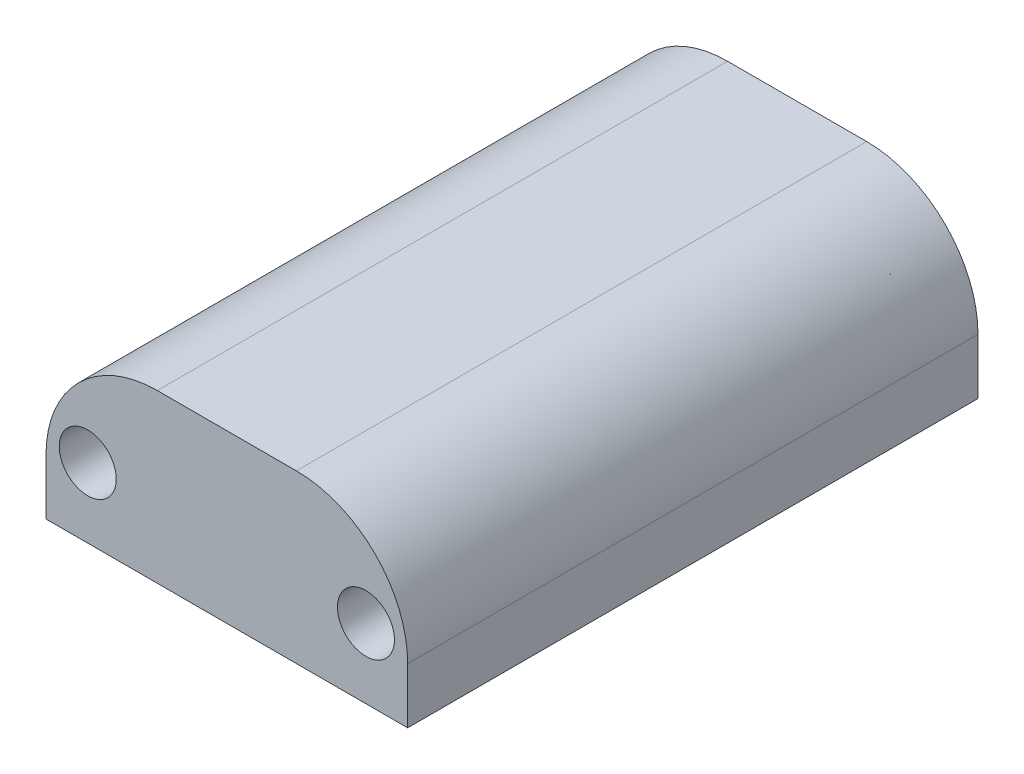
ISO-10303-21;
HEADER;
FILE_DESCRIPTION(('STEP AP214'),'2;1');
FILE_NAME('part.step','',(''),(''),'','','');
FILE_SCHEMA(('AUTOMOTIVE_DESIGN { 1 0 10303 214 1 1 1 1 }'));
ENDSEC;
DATA;
#1=APPLICATION_CONTEXT('core data for automotive mechanical design processes');
#2=APPLICATION_PROTOCOL_DEFINITION('international standard','automotive_design',2000,#1);
#3=PRODUCT_CONTEXT('',#1,'mechanical');
#4=PRODUCT('Part','Part','',(#3));
#5=PRODUCT_RELATED_PRODUCT_CATEGORY('part','',(#4));
#6=PRODUCT_DEFINITION_FORMATION('','',#4);
#7=PRODUCT_DEFINITION_CONTEXT('part definition',#1,'design');
#8=PRODUCT_DEFINITION('design','',#6,#7);
#9=PRODUCT_DEFINITION_SHAPE('','',#8);
#10=(LENGTH_UNIT() NAMED_UNIT(*) SI_UNIT(.MILLI.,.METRE.));
#11=(NAMED_UNIT(*) PLANE_ANGLE_UNIT() SI_UNIT($,.RADIAN.));
#12=(NAMED_UNIT(*) SI_UNIT($,.STERADIAN.) SOLID_ANGLE_UNIT());
#13=UNCERTAINTY_MEASURE_WITH_UNIT(LENGTH_MEASURE(1.E-05),#10,'distance_accuracy_value','');
#14=(GEOMETRIC_REPRESENTATION_CONTEXT(3) GLOBAL_UNCERTAINTY_ASSIGNED_CONTEXT((#13)) GLOBAL_UNIT_ASSIGNED_CONTEXT((#10,
#11,#12)) REPRESENTATION_CONTEXT('',''));
#15=CARTESIAN_POINT('',(0.,0.,0.));
#16=DIRECTION('',(0.,0.,1.));
#17=DIRECTION('',(1.,0.,0.));
#18=AXIS2_PLACEMENT_3D('',#15,#16,#17);
#19=CARTESIAN_POINT('',(13.,-6.,20.5));
#20=DIRECTION('',(-1.,0.,0.));
#21=DIRECTION('',(0.,0.,1.));
#22=AXIS2_PLACEMENT_3D('',#19,#20,#21);
#23=PLANE('',#22);
#24=DIRECTION('',(0.,1.,0.));
#25=VECTOR('',#24,1.);
#26=CARTESIAN_POINT('',(13.,-6.,-20.5));
#27=LINE('',#26,#25);
#28=CARTESIAN_POINT('',(13.,-6.,-20.5));
#29=VERTEX_POINT('',#28);
#30=CARTESIAN_POINT('',(13.,-2.,-20.5));
#31=VERTEX_POINT('',#30);
#32=EDGE_CURVE('E116',#29,#31,#27,.T.);
#33=ORIENTED_EDGE('',*,*,#32,.T.);
#34=DIRECTION('',(0.,0.,-1.));
#35=VECTOR('',#34,1.);
#36=CARTESIAN_POINT('',(13.,-2.,20.5));
#37=LINE('',#36,#35);
#38=CARTESIAN_POINT('',(13.,-2.,20.5));
#39=VERTEX_POINT('',#38);
#40=EDGE_CURVE('E11',#31,#39,#37,.F.);
#41=ORIENTED_EDGE('',*,*,#40,.T.);
#42=DIRECTION('',(0.,1.,0.));
#43=VECTOR('',#42,1.);
#44=CARTESIAN_POINT('',(13.,-6.,20.5));
#45=LINE('',#44,#43);
#46=CARTESIAN_POINT('',(13.,-6.,20.5));
#47=VERTEX_POINT('',#46);
#48=EDGE_CURVE('E123',#47,#39,#45,.T.);
#49=ORIENTED_EDGE('',*,*,#48,.F.);
#50=DIRECTION('',(0.,0.,-1.));
#51=VECTOR('',#50,1.);
#52=CARTESIAN_POINT('',(13.,-6.,20.5));
#53=LINE('',#52,#51);
#54=EDGE_CURVE('E108',#47,#29,#53,.T.);
#55=ORIENTED_EDGE('',*,*,#54,.T.);
#56=EDGE_LOOP('',(#33,#41,#49,#55));
#57=FACE_BOUND('',#56,.T.);
#58=ADVANCED_FACE('F34',(#57),#23,.F.);
#59=CARTESIAN_POINT('',(-13.,6.,20.5));
#60=DIRECTION('',(0.,-1.,0.));
#61=DIRECTION('',(0.,0.,-1.));
#62=AXIS2_PLACEMENT_3D('',#59,#60,#61);
#63=PLANE('',#62);
#64=DIRECTION('',(-1.,0.,0.));
#65=VECTOR('',#64,1.);
#66=CARTESIAN_POINT('',(-13.,6.,-20.5));
#67=LINE('',#66,#65);
#68=CARTESIAN_POINT('',(4.99999999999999,6.,-20.5));
#69=VERTEX_POINT('',#68);
#70=CARTESIAN_POINT('',(-5.,6.,-20.5));
#71=VERTEX_POINT('',#70);
#72=EDGE_CURVE('E118',#69,#71,#67,.T.);
#73=ORIENTED_EDGE('',*,*,#72,.T.);
#74=DIRECTION('',(0.,0.,-1.));
#75=VECTOR('',#74,1.);
#76=CARTESIAN_POINT('',(-5.,6.,20.5));
#77=LINE('',#76,#75);
#78=CARTESIAN_POINT('',(-5.,6.,20.5));
#79=VERTEX_POINT('',#78);
#80=EDGE_CURVE('E55',#71,#79,#77,.F.);
#81=ORIENTED_EDGE('',*,*,#80,.T.);
#82=DIRECTION('',(-1.,0.,0.));
#83=VECTOR('',#82,1.);
#84=CARTESIAN_POINT('',(-13.,6.,20.5));
#85=LINE('',#84,#83);
#86=CARTESIAN_POINT('',(4.99999999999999,6.,20.5));
#87=VERTEX_POINT('',#86);
#88=EDGE_CURVE('E98',#87,#79,#85,.T.);
#89=ORIENTED_EDGE('',*,*,#88,.F.);
#90=DIRECTION('',(0.,0.,-1.));
#91=VECTOR('',#90,1.);
#92=CARTESIAN_POINT('',(5.,6.,20.5));
#93=LINE('',#92,#91);
#94=EDGE_CURVE('E130',#87,#69,#93,.T.);
#95=ORIENTED_EDGE('',*,*,#94,.T.);
#96=EDGE_LOOP('',(#73,#81,#89,#95));
#97=FACE_BOUND('',#96,.T.);
#98=ADVANCED_FACE('F138',(#97),#63,.F.);
#99=CARTESIAN_POINT('',(-13.,-6.,20.5));
#100=DIRECTION('',(1.,0.,0.));
#101=DIRECTION('',(0.,0.,-1.));
#102=AXIS2_PLACEMENT_3D('',#99,#100,#101);
#103=PLANE('',#102);
#104=DIRECTION('',(0.,-1.,0.));
#105=VECTOR('',#104,1.);
#106=CARTESIAN_POINT('',(-13.,-6.,20.5));
#107=LINE('',#106,#105);
#108=CARTESIAN_POINT('',(-13.,-2.,20.5));
#109=VERTEX_POINT('',#108);
#110=CARTESIAN_POINT('',(-13.,-6.,20.5));
#111=VERTEX_POINT('',#110);
#112=EDGE_CURVE('E88',#109,#111,#107,.T.);
#113=ORIENTED_EDGE('',*,*,#112,.F.);
#114=DIRECTION('',(0.,0.,-1.));
#115=VECTOR('',#114,1.);
#116=CARTESIAN_POINT('',(-13.,-2.,20.5));
#117=LINE('',#116,#115);
#118=CARTESIAN_POINT('',(-13.,-2.,-20.5));
#119=VERTEX_POINT('',#118);
#120=EDGE_CURVE('E107',#109,#119,#117,.T.);
#121=ORIENTED_EDGE('',*,*,#120,.T.);
#122=DIRECTION('',(0.,-1.,0.));
#123=VECTOR('',#122,1.);
#124=CARTESIAN_POINT('',(-13.,-6.,-20.5));
#125=LINE('',#124,#123);
#126=CARTESIAN_POINT('',(-13.,-6.,-20.5));
#127=VERTEX_POINT('',#126);
#128=EDGE_CURVE('E104',#119,#127,#125,.T.);
#129=ORIENTED_EDGE('',*,*,#128,.T.);
#130=DIRECTION('',(0.,0.,-1.));
#131=VECTOR('',#130,1.);
#132=CARTESIAN_POINT('',(-13.,-6.,20.5));
#133=LINE('',#132,#131);
#134=EDGE_CURVE('E101',#111,#127,#133,.T.);
#135=ORIENTED_EDGE('',*,*,#134,.F.);
#136=EDGE_LOOP('',(#113,#121,#129,#135));
#137=FACE_BOUND('',#136,.T.);
#138=ADVANCED_FACE('F102',(#137),#103,.F.);
#139=CARTESIAN_POINT('',(-13.,-6.,20.5));
#140=DIRECTION('',(0.,1.,0.));
#141=DIRECTION('',(0.,0.,1.));
#142=AXIS2_PLACEMENT_3D('',#139,#140,#141);
#143=PLANE('',#142);
#144=DIRECTION('',(1.,0.,0.));
#145=VECTOR('',#144,1.);
#146=CARTESIAN_POINT('',(-13.,-6.,-20.5));
#147=LINE('',#146,#145);
#148=EDGE_CURVE('E122',#127,#29,#147,.T.);
#149=ORIENTED_EDGE('',*,*,#148,.T.);
#150=ORIENTED_EDGE('',*,*,#54,.F.);
#151=DIRECTION('',(1.,0.,0.));
#152=VECTOR('',#151,1.);
#153=CARTESIAN_POINT('',(-13.,-6.,20.5));
#154=LINE('',#153,#152);
#155=EDGE_CURVE('E92',#111,#47,#154,.T.);
#156=ORIENTED_EDGE('',*,*,#155,.F.);
#157=ORIENTED_EDGE('',*,*,#134,.T.);
#158=EDGE_LOOP('',(#149,#150,#156,#157));
#159=FACE_BOUND('',#158,.T.);
#160=ADVANCED_FACE('F110',(#159),#143,.F.);
#161=CARTESIAN_POINT('',(0.,0.,20.5));
#162=DIRECTION('',(0.,0.,-1.));
#163=DIRECTION('',(-1.,0.,0.));
#164=AXIS2_PLACEMENT_3D('',#161,#162,#163);
#165=PLANE('',#164);
#166=CARTESIAN_POINT('',(10.,-1.,20.5));
#167=DIRECTION('',(0.,0.,1.));
#168=DIRECTION('',(1.,0.,0.));
#169=AXIS2_PLACEMENT_3D('',#166,#167,#168);
#170=CIRCLE('',#169,2.05);
#171=CARTESIAN_POINT('',(12.05,-1.,20.5));
#172=VERTEX_POINT('',#171);
#173=EDGE_CURVE('E153',#172,#172,#170,.T.);
#174=ORIENTED_EDGE('',*,*,#173,.F.);
#175=EDGE_LOOP('',(#174));
#176=FACE_BOUND('',#175,.T.);
#177=CARTESIAN_POINT('',(-10.,-1.,20.5));
#178=DIRECTION('',(0.,0.,1.));
#179=DIRECTION('',(1.,0.,0.));
#180=AXIS2_PLACEMENT_3D('',#177,#178,#179);
#181=CIRCLE('',#180,2.05);
#182=CARTESIAN_POINT('',(-7.95,-1.,20.5));
#183=VERTEX_POINT('',#182);
#184=EDGE_CURVE('E147',#183,#183,#181,.T.);
#185=ORIENTED_EDGE('',*,*,#184,.F.);
#186=EDGE_LOOP('',(#185));
#187=FACE_BOUND('',#186,.T.);
#188=ORIENTED_EDGE('',*,*,#88,.T.);
#189=CARTESIAN_POINT('',(-5.,-2.,20.5));
#190=DIRECTION('',(0.,0.,-1.));
#191=DIRECTION('',(-1.,0.,0.));
#192=AXIS2_PLACEMENT_3D('',#189,#190,#191);
#193=CIRCLE('',#192,8.);
#194=EDGE_CURVE('E42',#79,#109,#193,.F.);
#195=ORIENTED_EDGE('',*,*,#194,.T.);
#196=ORIENTED_EDGE('',*,*,#112,.T.);
#197=ORIENTED_EDGE('',*,*,#155,.T.);
#198=ORIENTED_EDGE('',*,*,#48,.T.);
#199=CARTESIAN_POINT('',(5.,-2.,20.5));
#200=DIRECTION('',(0.,0.,-1.));
#201=DIRECTION('',(-1.,0.,0.));
#202=AXIS2_PLACEMENT_3D('',#199,#200,#201);
#203=CIRCLE('',#202,8.);
#204=EDGE_CURVE('E134',#39,#87,#203,.F.);
#205=ORIENTED_EDGE('',*,*,#204,.T.);
#206=EDGE_LOOP('',(#188,#195,#196,#197,#198,#205));
#207=FACE_BOUND('',#206,.T.);
#208=ADVANCED_FACE('F90',(#176,#187,#207),#165,.F.);
#209=CARTESIAN_POINT('',(0.,0.,-20.5));
#210=DIRECTION('',(0.,0.,-1.));
#211=DIRECTION('',(-1.,0.,0.));
#212=AXIS2_PLACEMENT_3D('',#209,#210,#211);
#213=PLANE('',#212);
#214=CARTESIAN_POINT('',(10.,-1.,-20.5));
#215=DIRECTION('',(0.,0.,-1.));
#216=DIRECTION('',(-1.,0.,0.));
#217=AXIS2_PLACEMENT_3D('',#214,#215,#216);
#218=CIRCLE('',#217,2.05);
#219=CARTESIAN_POINT('',(7.95,-1.,-20.5));
#220=VERTEX_POINT('',#219);
#221=EDGE_CURVE('E150',#220,#220,#218,.F.);
#222=ORIENTED_EDGE('',*,*,#221,.T.);
#223=EDGE_LOOP('',(#222));
#224=FACE_BOUND('',#223,.T.);
#225=CARTESIAN_POINT('',(-10.,-1.,-20.5));
#226=DIRECTION('',(0.,0.,-1.));
#227=DIRECTION('',(-1.,0.,0.));
#228=AXIS2_PLACEMENT_3D('',#225,#226,#227);
#229=CIRCLE('',#228,2.05);
#230=CARTESIAN_POINT('',(-12.05,-1.,-20.5));
#231=VERTEX_POINT('',#230);
#232=EDGE_CURVE('E119',#231,#231,#229,.F.);
#233=ORIENTED_EDGE('',*,*,#232,.T.);
#234=EDGE_LOOP('',(#233));
#235=FACE_BOUND('',#234,.T.);
#236=ORIENTED_EDGE('',*,*,#128,.F.);
#237=CARTESIAN_POINT('',(-5.,-2.,-20.5));
#238=DIRECTION('',(0.,0.,-1.));
#239=DIRECTION('',(-1.,0.,0.));
#240=AXIS2_PLACEMENT_3D('',#237,#238,#239);
#241=CIRCLE('',#240,8.);
#242=EDGE_CURVE('E128',#119,#71,#241,.T.);
#243=ORIENTED_EDGE('',*,*,#242,.T.);
#244=ORIENTED_EDGE('',*,*,#72,.F.);
#245=CARTESIAN_POINT('',(5.,-2.,-20.5));
#246=DIRECTION('',(0.,0.,-1.));
#247=DIRECTION('',(-1.,0.,0.));
#248=AXIS2_PLACEMENT_3D('',#245,#246,#247);
#249=CIRCLE('',#248,8.);
#250=EDGE_CURVE('E126',#69,#31,#249,.T.);
#251=ORIENTED_EDGE('',*,*,#250,.T.);
#252=ORIENTED_EDGE('',*,*,#32,.F.);
#253=ORIENTED_EDGE('',*,*,#148,.F.);
#254=EDGE_LOOP('',(#236,#243,#244,#251,#252,#253));
#255=FACE_BOUND('',#254,.T.);
#256=ADVANCED_FACE('F142',(#224,#235,#255),#213,.T.);
#257=CARTESIAN_POINT('',(-5.,-2.,20.5));
#258=DIRECTION('',(0.,0.,-1.));
#259=DIRECTION('',(-1.,0.,0.));
#260=AXIS2_PLACEMENT_3D('',#257,#258,#259);
#261=CYLINDRICAL_SURFACE('',#260,8.);
#262=ORIENTED_EDGE('',*,*,#194,.F.);
#263=ORIENTED_EDGE('',*,*,#80,.F.);
#264=ORIENTED_EDGE('',*,*,#242,.F.);
#265=ORIENTED_EDGE('',*,*,#120,.F.);
#266=EDGE_LOOP('',(#262,#263,#264,#265));
#267=FACE_BOUND('',#266,.T.);
#268=ADVANCED_FACE('F172',(#267),#261,.T.);
#269=CARTESIAN_POINT('',(5.,-2.,20.5));
#270=DIRECTION('',(0.,0.,-1.));
#271=DIRECTION('',(-1.,0.,0.));
#272=AXIS2_PLACEMENT_3D('',#269,#270,#271);
#273=CYLINDRICAL_SURFACE('',#272,8.);
#274=ORIENTED_EDGE('',*,*,#204,.F.);
#275=ORIENTED_EDGE('',*,*,#40,.F.);
#276=ORIENTED_EDGE('',*,*,#250,.F.);
#277=ORIENTED_EDGE('',*,*,#94,.F.);
#278=EDGE_LOOP('',(#274,#275,#276,#277));
#279=FACE_BOUND('',#278,.T.);
#280=ADVANCED_FACE('F36',(#279),#273,.T.);
#281=CARTESIAN_POINT('',(-10.,-1.,-26.2982756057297));
#282=DIRECTION('',(0.,0.,1.));
#283=DIRECTION('',(1.,0.,0.));
#284=AXIS2_PLACEMENT_3D('',#281,#282,#283);
#285=CYLINDRICAL_SURFACE('',#284,2.05);
#286=ORIENTED_EDGE('',*,*,#184,.T.);
#287=EDGE_LOOP('',(#286));
#288=FACE_BOUND('',#287,.T.);
#289=ORIENTED_EDGE('',*,*,#232,.F.);
#290=EDGE_LOOP('',(#289));
#291=FACE_BOUND('',#290,.T.);
#292=ADVANCED_FACE('F165',(#288,#291),#285,.F.);
#293=CARTESIAN_POINT('',(10.,-1.,-26.2982756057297));
#294=DIRECTION('',(0.,0.,1.));
#295=DIRECTION('',(1.,0.,0.));
#296=AXIS2_PLACEMENT_3D('',#293,#294,#295);
#297=CYLINDRICAL_SURFACE('',#296,2.05);
#298=ORIENTED_EDGE('',*,*,#173,.T.);
#299=EDGE_LOOP('',(#298));
#300=FACE_BOUND('',#299,.T.);
#301=ORIENTED_EDGE('',*,*,#221,.F.);
#302=EDGE_LOOP('',(#301));
#303=FACE_BOUND('',#302,.T.);
#304=ADVANCED_FACE('F157',(#300,#303),#297,.F.);
#305=CLOSED_SHELL('',(#58,#98,#138,#160,#208,#256,#268,#280,#292,#304));
#306=MANIFOLD_SOLID_BREP('B2',#305);
#307=ADVANCED_BREP_SHAPE_REPRESENTATION('',(#18,#306),#14);
#308=SHAPE_DEFINITION_REPRESENTATION(#9,#307);
ENDSEC;
END-ISO-10303-21;
